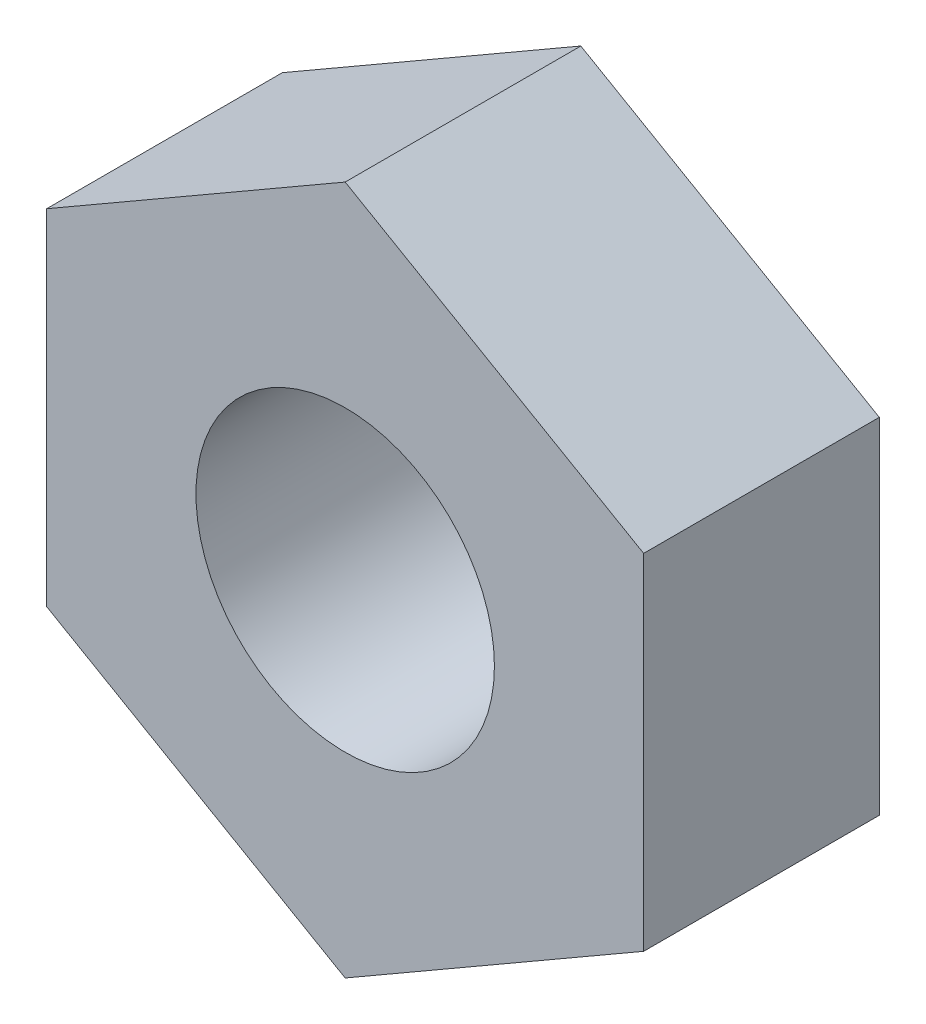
ISO-10303-21;
HEADER;
FILE_DESCRIPTION(('STEP AP214'),'2;1');
FILE_NAME('part.step','',(''),(''),'','','');
FILE_SCHEMA(('AUTOMOTIVE_DESIGN { 1 0 10303 214 1 1 1 1 }'));
ENDSEC;
DATA;
#1=APPLICATION_CONTEXT('core data for automotive mechanical design processes');
#2=APPLICATION_PROTOCOL_DEFINITION('international standard','automotive_design',2000,#1);
#3=PRODUCT_CONTEXT('',#1,'mechanical');
#4=PRODUCT('Part','Part','',(#3));
#5=PRODUCT_RELATED_PRODUCT_CATEGORY('part','',(#4));
#6=PRODUCT_DEFINITION_FORMATION('','',#4);
#7=PRODUCT_DEFINITION_CONTEXT('part definition',#1,'design');
#8=PRODUCT_DEFINITION('design','',#6,#7);
#9=PRODUCT_DEFINITION_SHAPE('','',#8);
#10=(LENGTH_UNIT() NAMED_UNIT(*) SI_UNIT(.MILLI.,.METRE.));
#11=(NAMED_UNIT(*) PLANE_ANGLE_UNIT() SI_UNIT($,.RADIAN.));
#12=(NAMED_UNIT(*) SI_UNIT($,.STERADIAN.) SOLID_ANGLE_UNIT());
#13=UNCERTAINTY_MEASURE_WITH_UNIT(LENGTH_MEASURE(1.E-05),#10,'distance_accuracy_value','');
#14=(GEOMETRIC_REPRESENTATION_CONTEXT(3) GLOBAL_UNCERTAINTY_ASSIGNED_CONTEXT((#13)) GLOBAL_UNIT_ASSIGNED_CONTEXT((#10,
#11,#12)) REPRESENTATION_CONTEXT('',''));
#15=CARTESIAN_POINT('',(0.,0.,0.));
#16=DIRECTION('',(0.,0.,1.));
#17=DIRECTION('',(1.,0.,0.));
#18=AXIS2_PLACEMENT_3D('',#15,#16,#17);
#19=CARTESIAN_POINT('',(-1.9,3.29089653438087,1.5));
#20=DIRECTION('',(0.,0.,1.));
#21=DIRECTION('',(1.,0.,0.));
#22=AXIS2_PLACEMENT_3D('',#19,#20,#21);
#23=PLANE('',#22);
#24=DIRECTION('',(-0.866025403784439,0.5,0.));
#25=VECTOR('',#24,1.);
#26=CARTESIAN_POINT('',(1.9,1.09696551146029,1.5));
#27=LINE('',#26,#25);
#28=CARTESIAN_POINT('',(1.9,1.09696551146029,1.5));
#29=VERTEX_POINT('',#28);
#30=CARTESIAN_POINT('',(0.,2.19393102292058,1.5));
#31=VERTEX_POINT('',#30);
#32=EDGE_CURVE('E116',#29,#31,#27,.T.);
#33=ORIENTED_EDGE('',*,*,#32,.T.);
#34=DIRECTION('',(-0.866025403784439,-0.5,0.));
#35=VECTOR('',#34,1.);
#36=CARTESIAN_POINT('',(0.,2.19393102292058,1.5));
#37=LINE('',#36,#35);
#38=CARTESIAN_POINT('',(-1.9,1.09696551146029,1.5));
#39=VERTEX_POINT('',#38);
#40=EDGE_CURVE('E97',#31,#39,#37,.T.);
#41=ORIENTED_EDGE('',*,*,#40,.T.);
#42=DIRECTION('',(0.,-1.,0.));
#43=VECTOR('',#42,1.);
#44=CARTESIAN_POINT('',(-1.9,1.09696551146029,1.5));
#45=LINE('',#44,#43);
#46=CARTESIAN_POINT('',(-1.9,-1.09696551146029,1.5));
#47=VERTEX_POINT('',#46);
#48=EDGE_CURVE('E119',#39,#47,#45,.T.);
#49=ORIENTED_EDGE('',*,*,#48,.T.);
#50=DIRECTION('',(0.866025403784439,-0.5,0.));
#51=VECTOR('',#50,1.);
#52=CARTESIAN_POINT('',(-1.9,-1.09696551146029,1.5));
#53=LINE('',#52,#51);
#54=CARTESIAN_POINT('',(0.,-2.19393102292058,1.5));
#55=VERTEX_POINT('',#54);
#56=EDGE_CURVE('E121',#47,#55,#53,.T.);
#57=ORIENTED_EDGE('',*,*,#56,.T.);
#58=DIRECTION('',(0.866025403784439,0.5,0.));
#59=VECTOR('',#58,1.);
#60=CARTESIAN_POINT('',(0.,-2.19393102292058,1.5));
#61=LINE('',#60,#59);
#62=CARTESIAN_POINT('',(1.9,-1.09696551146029,1.5));
#63=VERTEX_POINT('',#62);
#64=EDGE_CURVE('E50',#55,#63,#61,.T.);
#65=ORIENTED_EDGE('',*,*,#64,.T.);
#66=DIRECTION('',(0.,1.,0.));
#67=VECTOR('',#66,1.);
#68=CARTESIAN_POINT('',(1.9,-1.09696551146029,1.5));
#69=LINE('',#68,#67);
#70=EDGE_CURVE('E45',#63,#29,#69,.T.);
#71=ORIENTED_EDGE('',*,*,#70,.T.);
#72=EDGE_LOOP('',(#33,#41,#49,#57,#65,#71));
#73=FACE_BOUND('',#72,.T.);
#74=CARTESIAN_POINT('',(0.,0.,1.5));
#75=DIRECTION('',(0.,0.,1.));
#76=DIRECTION('',(1.,0.,0.));
#77=AXIS2_PLACEMENT_3D('',#74,#75,#76);
#78=CIRCLE('',#77,0.95);
#79=CARTESIAN_POINT('',(0.95,0.,1.5));
#80=VERTEX_POINT('',#79);
#81=EDGE_CURVE('E102',#80,#80,#78,.T.);
#82=ORIENTED_EDGE('',*,*,#81,.F.);
#83=EDGE_LOOP('',(#82));
#84=FACE_BOUND('',#83,.T.);
#85=ADVANCED_FACE('F30',(#73,#84),#23,.T.);
#86=CARTESIAN_POINT('',(-1.9,3.29089653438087,0.));
#87=DIRECTION('',(0.,0.,1.));
#88=DIRECTION('',(1.,0.,0.));
#89=AXIS2_PLACEMENT_3D('',#86,#87,#88);
#90=PLANE('',#89);
#91=DIRECTION('',(-0.866025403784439,0.5,0.));
#92=VECTOR('',#91,1.);
#93=CARTESIAN_POINT('',(1.9,1.09696551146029,0.));
#94=LINE('',#93,#92);
#95=CARTESIAN_POINT('',(1.9,1.09696551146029,0.));
#96=VERTEX_POINT('',#95);
#97=CARTESIAN_POINT('',(0.,2.19393102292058,0.));
#98=VERTEX_POINT('',#97);
#99=EDGE_CURVE('E88',#96,#98,#94,.T.);
#100=ORIENTED_EDGE('',*,*,#99,.F.);
#101=DIRECTION('',(0.,1.,0.));
#102=VECTOR('',#101,1.);
#103=CARTESIAN_POINT('',(1.9,-1.09696551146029,0.));
#104=LINE('',#103,#102);
#105=CARTESIAN_POINT('',(1.9,-1.09696551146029,0.));
#106=VERTEX_POINT('',#105);
#107=EDGE_CURVE('E114',#106,#96,#104,.T.);
#108=ORIENTED_EDGE('',*,*,#107,.F.);
#109=DIRECTION('',(0.866025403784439,0.5,0.));
#110=VECTOR('',#109,1.);
#111=CARTESIAN_POINT('',(0.,-2.19393102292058,0.));
#112=LINE('',#111,#110);
#113=CARTESIAN_POINT('',(0.,-2.19393102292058,0.));
#114=VERTEX_POINT('',#113);
#115=EDGE_CURVE('E112',#114,#106,#112,.T.);
#116=ORIENTED_EDGE('',*,*,#115,.F.);
#117=DIRECTION('',(0.866025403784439,-0.5,0.));
#118=VECTOR('',#117,1.);
#119=CARTESIAN_POINT('',(-1.9,-1.09696551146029,0.));
#120=LINE('',#119,#118);
#121=CARTESIAN_POINT('',(-1.9,-1.09696551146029,0.));
#122=VERTEX_POINT('',#121);
#123=EDGE_CURVE('E110',#122,#114,#120,.T.);
#124=ORIENTED_EDGE('',*,*,#123,.F.);
#125=DIRECTION('',(0.,-1.,0.));
#126=VECTOR('',#125,1.);
#127=CARTESIAN_POINT('',(-1.9,1.09696551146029,0.));
#128=LINE('',#127,#126);
#129=CARTESIAN_POINT('',(-1.9,1.09696551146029,0.));
#130=VERTEX_POINT('',#129);
#131=EDGE_CURVE('E90',#130,#122,#128,.T.);
#132=ORIENTED_EDGE('',*,*,#131,.F.);
#133=DIRECTION('',(-0.866025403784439,-0.5,0.));
#134=VECTOR('',#133,1.);
#135=CARTESIAN_POINT('',(0.,2.19393102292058,0.));
#136=LINE('',#135,#134);
#137=EDGE_CURVE('E83',#98,#130,#136,.T.);
#138=ORIENTED_EDGE('',*,*,#137,.F.);
#139=EDGE_LOOP('',(#100,#108,#116,#124,#132,#138));
#140=FACE_BOUND('',#139,.T.);
#141=CARTESIAN_POINT('',(0.,0.,0.));
#142=DIRECTION('',(0.,0.,1.));
#143=DIRECTION('',(1.,0.,0.));
#144=AXIS2_PLACEMENT_3D('',#141,#142,#143);
#145=CIRCLE('',#144,0.95);
#146=CARTESIAN_POINT('',(0.95,0.,0.));
#147=VERTEX_POINT('',#146);
#148=EDGE_CURVE('E105',#147,#147,#145,.T.);
#149=ORIENTED_EDGE('',*,*,#148,.T.);
#150=EDGE_LOOP('',(#149));
#151=FACE_BOUND('',#150,.T.);
#152=ADVANCED_FACE('F84',(#140,#151),#90,.F.);
#153=CARTESIAN_POINT('',(1.9,1.09696551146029,1.5));
#154=DIRECTION('',(-0.5,-0.866025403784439,0.));
#155=DIRECTION('',(0.866025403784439,-0.5,0.));
#156=AXIS2_PLACEMENT_3D('',#153,#154,#155);
#157=PLANE('',#156);
#158=ORIENTED_EDGE('',*,*,#99,.T.);
#159=DIRECTION('',(0.,0.,-1.));
#160=VECTOR('',#159,1.);
#161=CARTESIAN_POINT('',(0.,2.19393102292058,1.5));
#162=LINE('',#161,#160);
#163=EDGE_CURVE('E11',#31,#98,#162,.T.);
#164=ORIENTED_EDGE('',*,*,#163,.F.);
#165=ORIENTED_EDGE('',*,*,#32,.F.);
#166=DIRECTION('',(0.,0.,-1.));
#167=VECTOR('',#166,1.);
#168=CARTESIAN_POINT('',(1.9,1.09696551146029,1.5));
#169=LINE('',#168,#167);
#170=EDGE_CURVE('E101',#29,#96,#169,.T.);
#171=ORIENTED_EDGE('',*,*,#170,.T.);
#172=EDGE_LOOP('',(#158,#164,#165,#171));
#173=FACE_BOUND('',#172,.T.);
#174=ADVANCED_FACE('F32',(#173),#157,.F.);
#175=CARTESIAN_POINT('',(0.,2.19393102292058,1.5));
#176=DIRECTION('',(0.5,-0.866025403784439,0.));
#177=DIRECTION('',(0.866025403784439,0.5,0.));
#178=AXIS2_PLACEMENT_3D('',#175,#176,#177);
#179=PLANE('',#178);
#180=ORIENTED_EDGE('',*,*,#137,.T.);
#181=DIRECTION('',(0.,0.,-1.));
#182=VECTOR('',#181,1.);
#183=CARTESIAN_POINT('',(-1.9,1.09696551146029,1.5));
#184=LINE('',#183,#182);
#185=EDGE_CURVE('E38',#39,#130,#184,.T.);
#186=ORIENTED_EDGE('',*,*,#185,.F.);
#187=ORIENTED_EDGE('',*,*,#40,.F.);
#188=ORIENTED_EDGE('',*,*,#163,.T.);
#189=EDGE_LOOP('',(#180,#186,#187,#188));
#190=FACE_BOUND('',#189,.T.);
#191=ADVANCED_FACE('F96',(#190),#179,.F.);
#192=CARTESIAN_POINT('',(-1.9,1.09696551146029,1.5));
#193=DIRECTION('',(1.,0.,0.));
#194=DIRECTION('',(0.,1.,0.));
#195=AXIS2_PLACEMENT_3D('',#192,#193,#194);
#196=PLANE('',#195);
#197=ORIENTED_EDGE('',*,*,#131,.T.);
#198=DIRECTION('',(0.,0.,-1.));
#199=VECTOR('',#198,1.);
#200=CARTESIAN_POINT('',(-1.9,-1.09696551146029,1.5));
#201=LINE('',#200,#199);
#202=EDGE_CURVE('E132',#47,#122,#201,.T.);
#203=ORIENTED_EDGE('',*,*,#202,.F.);
#204=ORIENTED_EDGE('',*,*,#48,.F.);
#205=ORIENTED_EDGE('',*,*,#185,.T.);
#206=EDGE_LOOP('',(#197,#203,#204,#205));
#207=FACE_BOUND('',#206,.T.);
#208=ADVANCED_FACE('F136',(#207),#196,.F.);
#209=CARTESIAN_POINT('',(-1.9,-1.09696551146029,1.5));
#210=DIRECTION('',(0.5,0.866025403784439,0.));
#211=DIRECTION('',(-0.866025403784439,0.5,0.));
#212=AXIS2_PLACEMENT_3D('',#209,#210,#211);
#213=PLANE('',#212);
#214=ORIENTED_EDGE('',*,*,#123,.T.);
#215=DIRECTION('',(0.,0.,-1.));
#216=VECTOR('',#215,1.);
#217=CARTESIAN_POINT('',(0.,-2.19393102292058,1.5));
#218=LINE('',#217,#216);
#219=EDGE_CURVE('E129',#55,#114,#218,.T.);
#220=ORIENTED_EDGE('',*,*,#219,.F.);
#221=ORIENTED_EDGE('',*,*,#56,.F.);
#222=ORIENTED_EDGE('',*,*,#202,.T.);
#223=EDGE_LOOP('',(#214,#220,#221,#222));
#224=FACE_BOUND('',#223,.T.);
#225=ADVANCED_FACE('F142',(#224),#213,.F.);
#226=CARTESIAN_POINT('',(0.,-2.19393102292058,1.5));
#227=DIRECTION('',(-0.5,0.866025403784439,0.));
#228=DIRECTION('',(-0.866025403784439,-0.5,0.));
#229=AXIS2_PLACEMENT_3D('',#226,#227,#228);
#230=PLANE('',#229);
#231=ORIENTED_EDGE('',*,*,#115,.T.);
#232=DIRECTION('',(0.,0.,-1.));
#233=VECTOR('',#232,1.);
#234=CARTESIAN_POINT('',(1.9,-1.09696551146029,1.5));
#235=LINE('',#234,#233);
#236=EDGE_CURVE('E126',#63,#106,#235,.T.);
#237=ORIENTED_EDGE('',*,*,#236,.F.);
#238=ORIENTED_EDGE('',*,*,#64,.F.);
#239=ORIENTED_EDGE('',*,*,#219,.T.);
#240=EDGE_LOOP('',(#231,#237,#238,#239));
#241=FACE_BOUND('',#240,.T.);
#242=ADVANCED_FACE('F145',(#241),#230,.F.);
#243=CARTESIAN_POINT('',(1.9,-1.09696551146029,1.5));
#244=DIRECTION('',(-1.,0.,0.));
#245=DIRECTION('',(0.,-1.,0.));
#246=AXIS2_PLACEMENT_3D('',#243,#244,#245);
#247=PLANE('',#246);
#248=ORIENTED_EDGE('',*,*,#107,.T.);
#249=ORIENTED_EDGE('',*,*,#170,.F.);
#250=ORIENTED_EDGE('',*,*,#70,.F.);
#251=ORIENTED_EDGE('',*,*,#236,.T.);
#252=EDGE_LOOP('',(#248,#249,#250,#251));
#253=FACE_BOUND('',#252,.T.);
#254=ADVANCED_FACE('F147',(#253),#247,.F.);
#255=CARTESIAN_POINT('',(0.,0.,1.5));
#256=DIRECTION('',(0.,0.,-1.));
#257=DIRECTION('',(-1.,0.,0.));
#258=AXIS2_PLACEMENT_3D('',#255,#256,#257);
#259=CYLINDRICAL_SURFACE('',#258,0.95);
#260=ORIENTED_EDGE('',*,*,#81,.T.);
#261=EDGE_LOOP('',(#260));
#262=FACE_BOUND('',#261,.T.);
#263=ORIENTED_EDGE('',*,*,#148,.F.);
#264=EDGE_LOOP('',(#263));
#265=FACE_BOUND('',#264,.T.);
#266=ADVANCED_FACE('F149',(#262,#265),#259,.F.);
#267=CLOSED_SHELL('',(#85,#152,#174,#191,#208,#225,#242,#254,#266));
#268=MANIFOLD_SOLID_BREP('B2',#267);
#269=ADVANCED_BREP_SHAPE_REPRESENTATION('',(#18,#268),#14);
#270=SHAPE_DEFINITION_REPRESENTATION(#9,#269);
ENDSEC;
END-ISO-10303-21;
